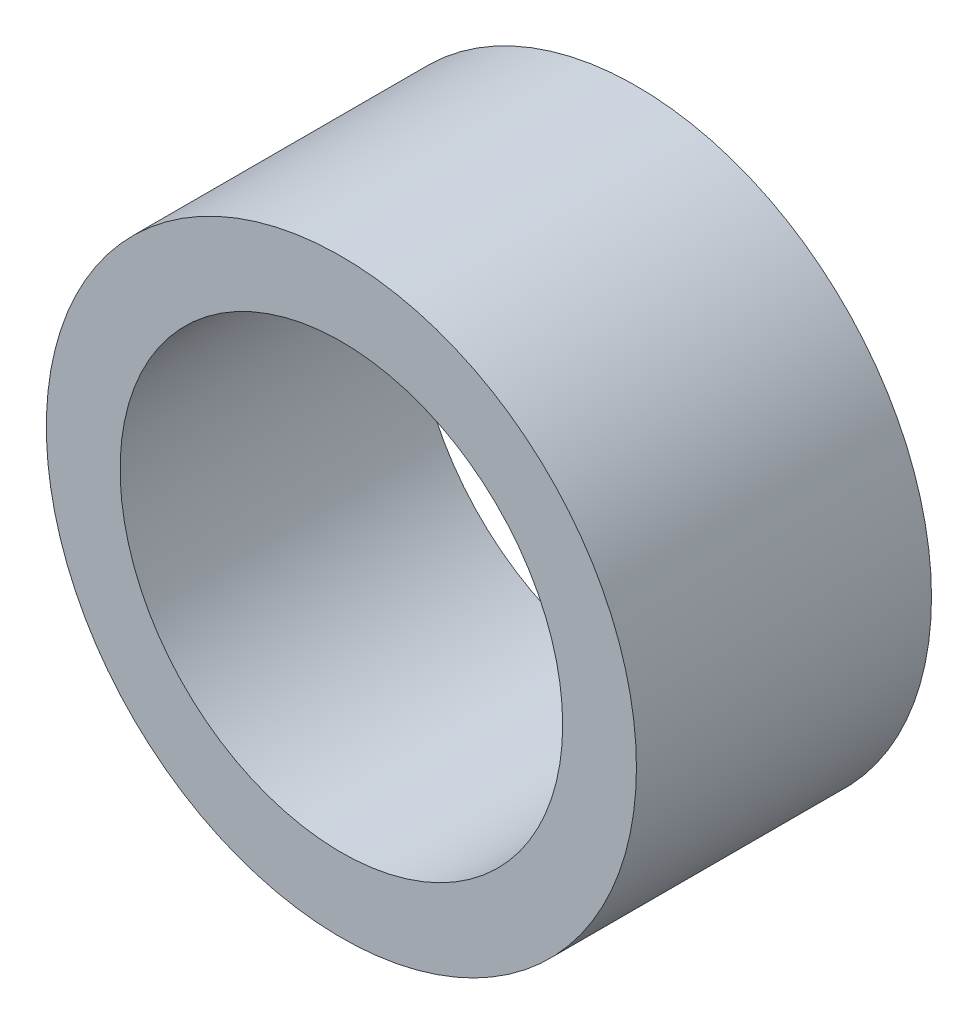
from build123d import *

# Parameters (mm, degrees)
SKETCH1_R           = 10
SKETCH1_R_2         = 7.5
BOSS_EXTRUDE1_DEPTH = 10


with BuildPart() as part:
    # Sketch1 → Boss-Extrude1 (new body)
    with BuildSketch(Plane.XY):
        Circle(SKETCH1_R)
        Circle(SKETCH1_R_2, mode=Mode.SUBTRACT)
    extrude(amount=BOSS_EXTRUDE1_DEPTH)


solid = part.part
